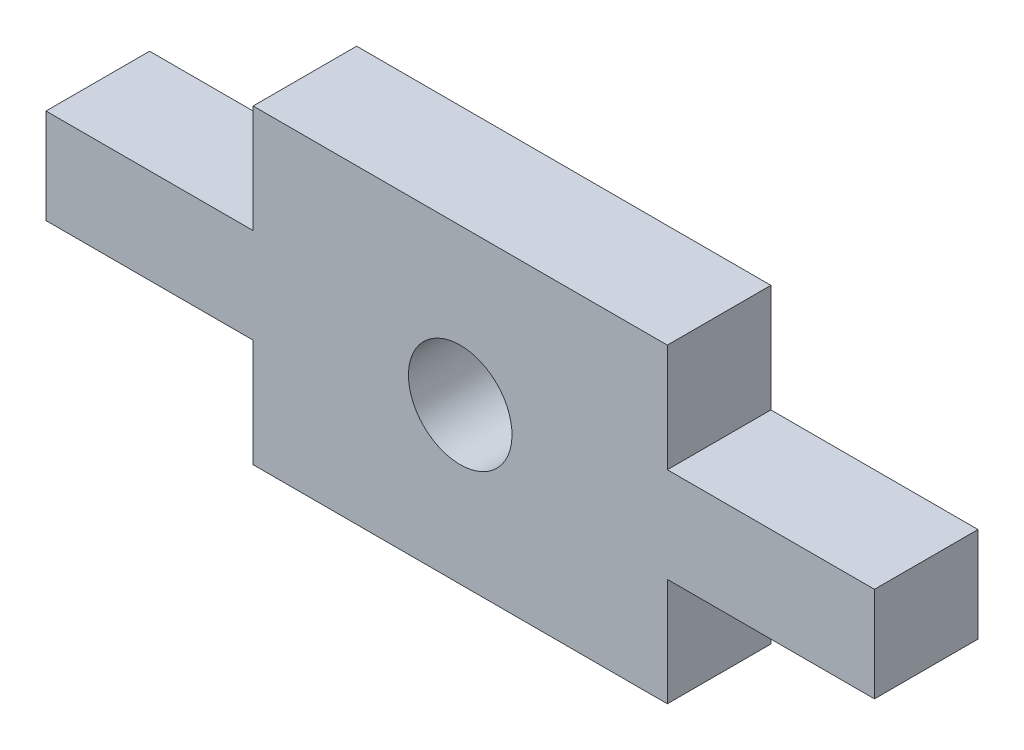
ISO-10303-21;
HEADER;
FILE_DESCRIPTION(('STEP AP214'),'2;1');
FILE_NAME('part.step','',(''),(''),'','','');
FILE_SCHEMA(('AUTOMOTIVE_DESIGN { 1 0 10303 214 1 1 1 1 }'));
ENDSEC;
DATA;
#1=APPLICATION_CONTEXT('core data for automotive mechanical design processes');
#2=APPLICATION_PROTOCOL_DEFINITION('international standard','automotive_design',2000,#1);
#3=PRODUCT_CONTEXT('',#1,'mechanical');
#4=PRODUCT('Part','Part','',(#3));
#5=PRODUCT_RELATED_PRODUCT_CATEGORY('part','',(#4));
#6=PRODUCT_DEFINITION_FORMATION('','',#4);
#7=PRODUCT_DEFINITION_CONTEXT('part definition',#1,'design');
#8=PRODUCT_DEFINITION('design','',#6,#7);
#9=PRODUCT_DEFINITION_SHAPE('','',#8);
#10=(LENGTH_UNIT() NAMED_UNIT(*) SI_UNIT(.MILLI.,.METRE.));
#11=(NAMED_UNIT(*) PLANE_ANGLE_UNIT() SI_UNIT($,.RADIAN.));
#12=(NAMED_UNIT(*) SI_UNIT($,.STERADIAN.) SOLID_ANGLE_UNIT());
#13=UNCERTAINTY_MEASURE_WITH_UNIT(LENGTH_MEASURE(1.E-05),#10,'distance_accuracy_value','');
#14=(GEOMETRIC_REPRESENTATION_CONTEXT(3) GLOBAL_UNCERTAINTY_ASSIGNED_CONTEXT((#13)) GLOBAL_UNIT_ASSIGNED_CONTEXT((#10,
#11,#12)) REPRESENTATION_CONTEXT('',''));
#15=CARTESIAN_POINT('',(0.,0.,0.));
#16=DIRECTION('',(0.,0.,1.));
#17=DIRECTION('',(1.,0.,0.));
#18=AXIS2_PLACEMENT_3D('',#15,#16,#17);
#19=CARTESIAN_POINT('',(-97.7445255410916,152.496309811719,0.));
#20=DIRECTION('',(0.,0.,-1.));
#21=DIRECTION('',(-1.,0.,0.));
#22=AXIS2_PLACEMENT_3D('',#19,#20,#21);
#23=PLANE('',#22);
#24=DIRECTION('',(1.,0.,0.));
#25=VECTOR('',#24,1.);
#26=CARTESIAN_POINT('',(4.95746685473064,0.295,0.));
#27=LINE('',#26,#25);
#28=CARTESIAN_POINT('',(4.95746685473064,0.295,0.));
#29=VERTEX_POINT('',#28);
#30=CARTESIAN_POINT('',(10.9574668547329,0.295,0.));
#31=VERTEX_POINT('',#30);
#32=EDGE_CURVE('E152',#29,#31,#27,.T.);
#33=ORIENTED_EDGE('',*,*,#32,.F.);
#34=DIRECTION('',(1.54666151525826E-13,-1.,0.));
#35=VECTOR('',#34,1.);
#36=CARTESIAN_POINT('',(4.9574668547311,0.421517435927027,0.));
#37=LINE('',#36,#35);
#38=CARTESIAN_POINT('',(4.95746685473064,3.42151743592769,0.));
#39=VERTEX_POINT('',#38);
#40=EDGE_CURVE('E148',#29,#39,#37,.F.);
#41=ORIENTED_EDGE('',*,*,#40,.T.);
#42=DIRECTION('',(1.,0.,0.));
#43=VECTOR('',#42,1.);
#44=CARTESIAN_POINT('',(-7.04253314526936,3.4215174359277,0.));
#45=LINE('',#44,#43);
#46=CARTESIAN_POINT('',(-7.04253314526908,3.4215174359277,0.));
#47=VERTEX_POINT('',#46);
#48=EDGE_CURVE('E218',#39,#47,#45,.F.);
#49=ORIENTED_EDGE('',*,*,#48,.T.);
#50=DIRECTION('',(-1.53283740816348E-13,1.,0.));
#51=VECTOR('',#50,1.);
#52=CARTESIAN_POINT('',(-7.04253314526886,0.421517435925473,0.));
#53=LINE('',#52,#51);
#54=CARTESIAN_POINT('',(-7.04253314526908,0.295,0.));
#55=VERTEX_POINT('',#54);
#56=EDGE_CURVE('E220',#47,#55,#53,.F.);
#57=ORIENTED_EDGE('',*,*,#56,.T.);
#58=DIRECTION('',(1.,0.,0.));
#59=VECTOR('',#58,1.);
#60=CARTESIAN_POINT('',(-7.04253314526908,0.295,0.));
#61=LINE('',#60,#59);
#62=CARTESIAN_POINT('',(-13.0425331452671,0.295,0.));
#63=VERTEX_POINT('',#62);
#64=EDGE_CURVE('E176',#63,#55,#61,.T.);
#65=ORIENTED_EDGE('',*,*,#64,.F.);
#66=DIRECTION('',(-1.60645092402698E-13,1.,0.));
#67=VECTOR('',#66,1.);
#68=CARTESIAN_POINT('',(-13.0425331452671,0.421517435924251,0.));
#69=LINE('',#68,#67);
#70=CARTESIAN_POINT('',(-13.0425331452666,-2.455,0.));
#71=VERTEX_POINT('',#70);
#72=EDGE_CURVE('E222',#63,#71,#69,.F.);
#73=ORIENTED_EDGE('',*,*,#72,.T.);
#74=DIRECTION('',(-1.,0.,0.));
#75=VECTOR('',#74,1.);
#76=CARTESIAN_POINT('',(-7.04253314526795,-2.455,0.));
#77=LINE('',#76,#75);
#78=CARTESIAN_POINT('',(-7.04253314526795,-2.455,0.));
#79=VERTEX_POINT('',#78);
#80=EDGE_CURVE('E165',#79,#71,#77,.T.);
#81=ORIENTED_EDGE('',*,*,#80,.F.);
#82=DIRECTION('',(-1.55967935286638E-13,1.,0.));
#83=VECTOR('',#82,1.);
#84=CARTESIAN_POINT('',(-7.04253314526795,-5.57848256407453,0.));
#85=LINE('',#84,#83);
#86=CARTESIAN_POINT('',(-7.04253314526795,-5.57848256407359,0.));
#87=VERTEX_POINT('',#86);
#88=EDGE_CURVE('E202',#79,#87,#85,.F.);
#89=ORIENTED_EDGE('',*,*,#88,.T.);
#90=DIRECTION('',(-1.,-1.56274561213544E-13,0.));
#91=VECTOR('',#90,1.);
#92=CARTESIAN_POINT('',(-7.04253314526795,-5.57848256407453,0.));
#93=LINE('',#92,#91);
#94=CARTESIAN_POINT('',(4.95746685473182,-5.57848256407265,0.));
#95=VERTEX_POINT('',#94);
#96=EDGE_CURVE('E206',#87,#95,#93,.F.);
#97=ORIENTED_EDGE('',*,*,#96,.T.);
#98=DIRECTION('',(1.54281545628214E-13,-1.,0.));
#99=VECTOR('',#98,1.);
#100=CARTESIAN_POINT('',(4.95746685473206,-5.57848256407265,0.));
#101=LINE('',#100,#99);
#102=CARTESIAN_POINT('',(4.95746685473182,-2.455,0.));
#103=VERTEX_POINT('',#102);
#104=EDGE_CURVE('E208',#95,#103,#101,.F.);
#105=ORIENTED_EDGE('',*,*,#104,.T.);
#106=DIRECTION('',(-1.,0.,0.));
#107=VECTOR('',#106,1.);
#108=CARTESIAN_POINT('',(4.95746685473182,-2.455,0.));
#109=LINE('',#108,#107);
#110=CARTESIAN_POINT('',(10.9574668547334,-2.455,0.));
#111=VERTEX_POINT('',#110);
#112=EDGE_CURVE('E157',#111,#103,#109,.T.);
#113=ORIENTED_EDGE('',*,*,#112,.F.);
#114=DIRECTION('',(1.67008639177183E-13,-1.,0.));
#115=VECTOR('',#114,1.);
#116=CARTESIAN_POINT('',(10.9574668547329,0.421517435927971,0.));
#117=LINE('',#116,#115);
#118=EDGE_CURVE('E210',#111,#31,#117,.F.);
#119=ORIENTED_EDGE('',*,*,#118,.T.);
#120=EDGE_LOOP('',(#33,#41,#49,#57,#65,#73,#81,#89,#97,#105,#113,#119));
#121=FACE_BOUND('',#120,.T.);
#122=CARTESIAN_POINT('',(-1.04253314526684,-1.07848256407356,0.));
#123=DIRECTION('',(0.,0.,-1.));
#124=DIRECTION('',(-1.,0.,0.));
#125=AXIS2_PLACEMENT_3D('',#122,#123,#124);
#126=CIRCLE('',#125,1.49999999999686);
#127=CARTESIAN_POINT('',(0.0359494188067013,-2.12101570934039,0.));
#128=VERTEX_POINT('',#127);
#129=CARTESIAN_POINT('',(-2.12101570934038,-0.0359494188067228,0.));
#130=VERTEX_POINT('',#129);
#131=EDGE_CURVE('E185',#128,#130,#126,.T.);
#132=ORIENTED_EDGE('',*,*,#131,.T.);
#133=CARTESIAN_POINT('',(-1.04253314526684,-1.07848256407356,0.));
#134=DIRECTION('',(0.,0.,-1.));
#135=DIRECTION('',(-1.,0.,0.));
#136=AXIS2_PLACEMENT_3D('',#133,#134,#135);
#137=CIRCLE('',#136,1.49999999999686);
#138=EDGE_CURVE('E225',#130,#128,#137,.T.);
#139=ORIENTED_EDGE('',*,*,#138,.T.);
#140=EDGE_LOOP('',(#132,#139));
#141=FACE_BOUND('',#140,.T.);
#142=ADVANCED_FACE('F30',(#121,#141),#23,.F.);
#143=CARTESIAN_POINT('',(-1.04253314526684,-1.07848256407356,0.));
#144=DIRECTION('',(0.,0.,-1.));
#145=DIRECTION('',(-1.,0.,0.));
#146=AXIS2_PLACEMENT_3D('',#143,#144,#145);
#147=CYLINDRICAL_SURFACE('',#146,1.49999999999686);
#148=CARTESIAN_POINT('',(-1.04253314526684,-1.07848256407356,-3.));
#149=DIRECTION('',(0.,0.,-1.));
#150=DIRECTION('',(-1.,0.,0.));
#151=AXIS2_PLACEMENT_3D('',#148,#149,#150);
#152=CIRCLE('',#151,1.49999999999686);
#153=CARTESIAN_POINT('',(-2.12101570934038,-0.0359494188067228,-3.));
#154=VERTEX_POINT('',#153);
#155=CARTESIAN_POINT('',(0.0359494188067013,-2.12101570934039,-3.));
#156=VERTEX_POINT('',#155);
#157=EDGE_CURVE('E201',#154,#156,#152,.F.);
#158=ORIENTED_EDGE('',*,*,#157,.F.);
#159=DIRECTION('',(0.,0.,-1.));
#160=VECTOR('',#159,1.);
#161=CARTESIAN_POINT('',(-2.12101570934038,-0.0359494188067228,0.));
#162=LINE('',#161,#160);
#163=EDGE_CURVE('E228',#154,#130,#162,.F.);
#164=ORIENTED_EDGE('',*,*,#163,.T.);
#165=ORIENTED_EDGE('',*,*,#131,.F.);
#166=DIRECTION('',(0.,0.,-1.));
#167=VECTOR('',#166,1.);
#168=CARTESIAN_POINT('',(0.0359494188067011,-2.12101570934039,0.));
#169=LINE('',#168,#167);
#170=EDGE_CURVE('E226',#128,#156,#169,.T.);
#171=ORIENTED_EDGE('',*,*,#170,.T.);
#172=EDGE_LOOP('',(#158,#164,#165,#171));
#173=FACE_BOUND('',#172,.T.);
#174=ADVANCED_FACE('F310',(#173),#147,.F.);
#175=CARTESIAN_POINT('',(-1.04253314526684,-1.07848256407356,0.));
#176=DIRECTION('',(0.,0.,-1.));
#177=DIRECTION('',(-1.,0.,0.));
#178=AXIS2_PLACEMENT_3D('',#175,#176,#177);
#179=CYLINDRICAL_SURFACE('',#178,1.49999999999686);
#180=ORIENTED_EDGE('',*,*,#163,.F.);
#181=CARTESIAN_POINT('',(-1.04253314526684,-1.07848256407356,-3.));
#182=DIRECTION('',(0.,0.,-1.));
#183=DIRECTION('',(-1.,0.,0.));
#184=AXIS2_PLACEMENT_3D('',#181,#182,#183);
#185=CIRCLE('',#184,1.49999999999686);
#186=EDGE_CURVE('E198',#156,#154,#185,.F.);
#187=ORIENTED_EDGE('',*,*,#186,.F.);
#188=ORIENTED_EDGE('',*,*,#170,.F.);
#189=ORIENTED_EDGE('',*,*,#138,.F.);
#190=EDGE_LOOP('',(#180,#187,#188,#189));
#191=FACE_BOUND('',#190,.T.);
#192=ADVANCED_FACE('F308',(#191),#179,.F.);
#193=CARTESIAN_POINT('',(-13.0425331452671,0.421517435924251,0.));
#194=DIRECTION('',(1.,1.60645092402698E-13,0.));
#195=DIRECTION('',(-1.60645092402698E-13,1.,0.));
#196=AXIS2_PLACEMENT_3D('',#193,#194,#195);
#197=PLANE('',#196);
#198=DIRECTION('',(0.,1.,0.));
#199=VECTOR('',#198,1.);
#200=CARTESIAN_POINT('',(-13.0425331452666,152.496309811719,-3.));
#201=LINE('',#200,#199);
#202=CARTESIAN_POINT('',(-13.0425331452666,-2.45500000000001,-3.));
#203=VERTEX_POINT('',#202);
#204=CARTESIAN_POINT('',(-13.0425331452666,0.295,-3.));
#205=VERTEX_POINT('',#204);
#206=EDGE_CURVE('E196',#203,#205,#201,.T.);
#207=ORIENTED_EDGE('',*,*,#206,.F.);
#208=DIRECTION('',(0.,0.,1.));
#209=VECTOR('',#208,1.);
#210=CARTESIAN_POINT('',(-13.0425331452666,-2.455,0.));
#211=LINE('',#210,#209);
#212=EDGE_CURVE('E173',#203,#71,#211,.T.);
#213=ORIENTED_EDGE('',*,*,#212,.T.);
#214=ORIENTED_EDGE('',*,*,#72,.F.);
#215=DIRECTION('',(0.,0.,-1.));
#216=VECTOR('',#215,1.);
#217=CARTESIAN_POINT('',(-13.0425331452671,0.295,0.));
#218=LINE('',#217,#216);
#219=EDGE_CURVE('E182',#63,#205,#218,.T.);
#220=ORIENTED_EDGE('',*,*,#219,.T.);
#221=EDGE_LOOP('',(#207,#213,#214,#220));
#222=FACE_BOUND('',#221,.T.);
#223=ADVANCED_FACE('F246',(#222),#197,.F.);
#224=CARTESIAN_POINT('',(-7.04253314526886,0.421517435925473,0.));
#225=DIRECTION('',(1.,1.53283740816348E-13,0.));
#226=DIRECTION('',(-1.53283740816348E-13,1.,0.));
#227=AXIS2_PLACEMENT_3D('',#224,#225,#226);
#228=PLANE('',#227);
#229=ORIENTED_EDGE('',*,*,#56,.F.);
#230=DIRECTION('',(0.,0.,1.));
#231=VECTOR('',#230,1.);
#232=CARTESIAN_POINT('',(-7.04253314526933,3.4215174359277,0.));
#233=LINE('',#232,#231);
#234=CARTESIAN_POINT('',(-7.0425331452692,3.4215174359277,-3.));
#235=VERTEX_POINT('',#234);
#236=EDGE_CURVE('E216',#47,#235,#233,.F.);
#237=ORIENTED_EDGE('',*,*,#236,.T.);
#238=DIRECTION('',(0.,1.,0.));
#239=VECTOR('',#238,1.);
#240=CARTESIAN_POINT('',(-7.04253314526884,152.496309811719,-3.));
#241=LINE('',#240,#239);
#242=CARTESIAN_POINT('',(-7.04253314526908,0.29499999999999,-3.));
#243=VERTEX_POINT('',#242);
#244=EDGE_CURVE('E194',#243,#235,#241,.T.);
#245=ORIENTED_EDGE('',*,*,#244,.F.);
#246=DIRECTION('',(0.,0.,1.));
#247=VECTOR('',#246,1.);
#248=CARTESIAN_POINT('',(-7.04253314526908,0.295,-3.));
#249=LINE('',#248,#247);
#250=EDGE_CURVE('E179',#243,#55,#249,.T.);
#251=ORIENTED_EDGE('',*,*,#250,.T.);
#252=EDGE_LOOP('',(#229,#237,#245,#251));
#253=FACE_BOUND('',#252,.T.);
#254=ADVANCED_FACE('F252',(#253),#228,.F.);
#255=CARTESIAN_POINT('',(-7.04253314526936,3.4215174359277,0.));
#256=DIRECTION('',(0.,-1.,0.));
#257=DIRECTION('',(1.,0.,0.));
#258=AXIS2_PLACEMENT_3D('',#255,#256,#257);
#259=PLANE('',#258);
#260=ORIENTED_EDGE('',*,*,#48,.F.);
#261=DIRECTION('',(0.,0.,1.));
#262=VECTOR('',#261,1.);
#263=CARTESIAN_POINT('',(4.95746685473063,3.4215174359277,0.));
#264=LINE('',#263,#262);
#265=CARTESIAN_POINT('',(4.95746685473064,3.42151743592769,-3.));
#266=VERTEX_POINT('',#265);
#267=EDGE_CURVE('E213',#39,#266,#264,.F.);
#268=ORIENTED_EDGE('',*,*,#267,.T.);
#269=DIRECTION('',(-1.,0.,0.));
#270=VECTOR('',#269,1.);
#271=CARTESIAN_POINT('',(-97.7445255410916,3.4215174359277,-3.));
#272=LINE('',#271,#270);
#273=EDGE_CURVE('E140',#235,#266,#272,.F.);
#274=ORIENTED_EDGE('',*,*,#273,.F.);
#275=ORIENTED_EDGE('',*,*,#236,.F.);
#276=EDGE_LOOP('',(#260,#268,#274,#275));
#277=FACE_BOUND('',#276,.T.);
#278=ADVANCED_FACE('F256',(#277),#259,.F.);
#279=CARTESIAN_POINT('',(4.9574668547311,0.421517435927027,0.));
#280=DIRECTION('',(-1.,-1.54666151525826E-13,0.));
#281=DIRECTION('',(1.54666151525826E-13,-1.,0.));
#282=AXIS2_PLACEMENT_3D('',#279,#280,#281);
#283=PLANE('',#282);
#284=ORIENTED_EDGE('',*,*,#40,.F.);
#285=DIRECTION('',(0.,0.,1.));
#286=VECTOR('',#285,1.);
#287=CARTESIAN_POINT('',(4.95746685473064,0.295,-3.));
#288=LINE('',#287,#286);
#289=CARTESIAN_POINT('',(4.95746685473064,0.295,-3.));
#290=VERTEX_POINT('',#289);
#291=EDGE_CURVE('E146',#290,#29,#288,.T.);
#292=ORIENTED_EDGE('',*,*,#291,.F.);
#293=DIRECTION('',(0.,1.,0.));
#294=VECTOR('',#293,1.);
#295=CARTESIAN_POINT('',(4.95746685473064,152.496309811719,-3.));
#296=LINE('',#295,#294);
#297=EDGE_CURVE('E132',#266,#290,#296,.F.);
#298=ORIENTED_EDGE('',*,*,#297,.F.);
#299=ORIENTED_EDGE('',*,*,#267,.F.);
#300=EDGE_LOOP('',(#284,#292,#298,#299));
#301=FACE_BOUND('',#300,.T.);
#302=ADVANCED_FACE('F147',(#301),#283,.F.);
#303=CARTESIAN_POINT('',(10.9574668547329,0.421517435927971,0.));
#304=DIRECTION('',(-1.,-1.67008639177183E-13,0.));
#305=DIRECTION('',(1.67008639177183E-13,-1.,0.));
#306=AXIS2_PLACEMENT_3D('',#303,#304,#305);
#307=PLANE('',#306);
#308=DIRECTION('',(0.,1.,0.));
#309=VECTOR('',#308,1.);
#310=CARTESIAN_POINT('',(10.9574668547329,152.496309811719,-3.));
#311=LINE('',#310,#309);
#312=CARTESIAN_POINT('',(10.9574668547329,0.29499999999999,-3.));
#313=VERTEX_POINT('',#312);
#314=CARTESIAN_POINT('',(10.9574668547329,-2.455,-3.));
#315=VERTEX_POINT('',#314);
#316=EDGE_CURVE('E143',#313,#315,#311,.F.);
#317=ORIENTED_EDGE('',*,*,#316,.F.);
#318=DIRECTION('',(0.,0.,1.));
#319=VECTOR('',#318,1.);
#320=CARTESIAN_POINT('',(10.9574668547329,0.295,0.));
#321=LINE('',#320,#319);
#322=EDGE_CURVE('E44',#313,#31,#321,.T.);
#323=ORIENTED_EDGE('',*,*,#322,.T.);
#324=ORIENTED_EDGE('',*,*,#118,.F.);
#325=DIRECTION('',(0.,0.,-1.));
#326=VECTOR('',#325,1.);
#327=CARTESIAN_POINT('',(10.9574668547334,-2.455,0.));
#328=LINE('',#327,#326);
#329=EDGE_CURVE('E162',#111,#315,#328,.T.);
#330=ORIENTED_EDGE('',*,*,#329,.T.);
#331=EDGE_LOOP('',(#317,#323,#324,#330));
#332=FACE_BOUND('',#331,.T.);
#333=ADVANCED_FACE('F260',(#332),#307,.F.);
#334=CARTESIAN_POINT('',(4.95746685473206,-5.57848256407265,0.));
#335=DIRECTION('',(-1.,-1.54281545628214E-13,0.));
#336=DIRECTION('',(1.54281545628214E-13,-1.,0.));
#337=AXIS2_PLACEMENT_3D('',#334,#335,#336);
#338=PLANE('',#337);
#339=ORIENTED_EDGE('',*,*,#104,.F.);
#340=DIRECTION('',(0.,0.,1.));
#341=VECTOR('',#340,1.);
#342=CARTESIAN_POINT('',(4.95746685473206,-5.57848256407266,0.));
#343=LINE('',#342,#341);
#344=CARTESIAN_POINT('',(4.95746685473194,-5.57848256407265,-3.));
#345=VERTEX_POINT('',#344);
#346=EDGE_CURVE('E204',#95,#345,#343,.F.);
#347=ORIENTED_EDGE('',*,*,#346,.T.);
#348=DIRECTION('',(0.,1.,0.));
#349=VECTOR('',#348,1.);
#350=CARTESIAN_POINT('',(4.95746685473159,152.496309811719,-3.));
#351=LINE('',#350,#349);
#352=CARTESIAN_POINT('',(4.95746685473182,-2.45500000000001,-3.));
#353=VERTEX_POINT('',#352);
#354=EDGE_CURVE('E52',#353,#345,#351,.F.);
#355=ORIENTED_EDGE('',*,*,#354,.F.);
#356=DIRECTION('',(0.,0.,1.));
#357=VECTOR('',#356,1.);
#358=CARTESIAN_POINT('',(4.95746685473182,-2.455,-3.));
#359=LINE('',#358,#357);
#360=EDGE_CURVE('E160',#353,#103,#359,.T.);
#361=ORIENTED_EDGE('',*,*,#360,.T.);
#362=EDGE_LOOP('',(#339,#347,#355,#361));
#363=FACE_BOUND('',#362,.T.);
#364=ADVANCED_FACE('F265',(#363),#338,.F.);
#365=CARTESIAN_POINT('',(-7.04253314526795,-5.57848256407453,0.));
#366=DIRECTION('',(-1.56274561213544E-13,1.,0.));
#367=DIRECTION('',(-1.,-1.56274561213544E-13,0.));
#368=AXIS2_PLACEMENT_3D('',#365,#366,#367);
#369=PLANE('',#368);
#370=ORIENTED_EDGE('',*,*,#96,.F.);
#371=DIRECTION('',(0.,0.,1.));
#372=VECTOR('',#371,1.);
#373=CARTESIAN_POINT('',(-7.04253314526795,-5.57848256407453,0.));
#374=LINE('',#373,#372);
#375=CARTESIAN_POINT('',(-7.04253314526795,-5.57848256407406,-3.));
#376=VERTEX_POINT('',#375);
#377=EDGE_CURVE('E199',#87,#376,#374,.F.);
#378=ORIENTED_EDGE('',*,*,#377,.T.);
#379=DIRECTION('',(-1.,0.,0.));
#380=VECTOR('',#379,1.);
#381=CARTESIAN_POINT('',(-97.7445255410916,-5.57848256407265,-3.));
#382=LINE('',#381,#380);
#383=EDGE_CURVE('E188',#345,#376,#382,.T.);
#384=ORIENTED_EDGE('',*,*,#383,.F.);
#385=ORIENTED_EDGE('',*,*,#346,.F.);
#386=EDGE_LOOP('',(#370,#378,#384,#385));
#387=FACE_BOUND('',#386,.T.);
#388=ADVANCED_FACE('F270',(#387),#369,.F.);
#389=CARTESIAN_POINT('',(-7.04253314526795,-5.57848256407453,0.));
#390=DIRECTION('',(1.,1.55967935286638E-13,0.));
#391=DIRECTION('',(-1.55967935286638E-13,1.,0.));
#392=AXIS2_PLACEMENT_3D('',#389,#390,#391);
#393=PLANE('',#392);
#394=ORIENTED_EDGE('',*,*,#88,.F.);
#395=DIRECTION('',(0.,0.,1.));
#396=VECTOR('',#395,1.);
#397=CARTESIAN_POINT('',(-7.04253314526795,-2.455,-3.));
#398=LINE('',#397,#396);
#399=CARTESIAN_POINT('',(-7.04253314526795,-2.455,-3.));
#400=VERTEX_POINT('',#399);
#401=EDGE_CURVE('E169',#400,#79,#398,.T.);
#402=ORIENTED_EDGE('',*,*,#401,.F.);
#403=DIRECTION('',(0.,1.,0.));
#404=VECTOR('',#403,1.);
#405=CARTESIAN_POINT('',(-7.04253314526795,152.496309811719,-3.));
#406=LINE('',#405,#404);
#407=EDGE_CURVE('E186',#376,#400,#406,.T.);
#408=ORIENTED_EDGE('',*,*,#407,.F.);
#409=ORIENTED_EDGE('',*,*,#377,.F.);
#410=EDGE_LOOP('',(#394,#402,#408,#409));
#411=FACE_BOUND('',#410,.T.);
#412=ADVANCED_FACE('F276',(#411),#393,.F.);
#413=CARTESIAN_POINT('',(-97.7445255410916,152.496309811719,-3.));
#414=DIRECTION('',(0.,0.,-1.));
#415=DIRECTION('',(-1.,0.,0.));
#416=AXIS2_PLACEMENT_3D('',#413,#414,#415);
#417=PLANE('',#416);
#418=ORIENTED_EDGE('',*,*,#297,.T.);
#419=DIRECTION('',(1.,0.,0.));
#420=VECTOR('',#419,1.);
#421=CARTESIAN_POINT('',(4.95746685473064,0.295,-3.));
#422=LINE('',#421,#420);
#423=EDGE_CURVE('E136',#290,#313,#422,.T.);
#424=ORIENTED_EDGE('',*,*,#423,.T.);
#425=ORIENTED_EDGE('',*,*,#316,.T.);
#426=DIRECTION('',(1.,0.,0.));
#427=VECTOR('',#426,1.);
#428=CARTESIAN_POINT('',(-97.7445255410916,-2.45500000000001,-3.));
#429=LINE('',#428,#427);
#430=EDGE_CURVE('E11',#353,#315,#429,.T.);
#431=ORIENTED_EDGE('',*,*,#430,.F.);
#432=ORIENTED_EDGE('',*,*,#354,.T.);
#433=ORIENTED_EDGE('',*,*,#383,.T.);
#434=ORIENTED_EDGE('',*,*,#407,.T.);
#435=DIRECTION('',(-1.,0.,0.));
#436=VECTOR('',#435,1.);
#437=CARTESIAN_POINT('',(-7.04253314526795,-2.455,-3.));
#438=LINE('',#437,#436);
#439=EDGE_CURVE('E166',#400,#203,#438,.T.);
#440=ORIENTED_EDGE('',*,*,#439,.T.);
#441=ORIENTED_EDGE('',*,*,#206,.T.);
#442=DIRECTION('',(-1.,0.,0.));
#443=VECTOR('',#442,1.);
#444=CARTESIAN_POINT('',(-97.7445255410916,0.29499999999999,-3.));
#445=LINE('',#444,#443);
#446=EDGE_CURVE('E37',#243,#205,#445,.T.);
#447=ORIENTED_EDGE('',*,*,#446,.F.);
#448=ORIENTED_EDGE('',*,*,#244,.T.);
#449=ORIENTED_EDGE('',*,*,#273,.T.);
#450=EDGE_LOOP('',(#418,#424,#425,#431,#432,#433,#434,#440,#441,#447,#448,#449));
#451=FACE_BOUND('',#450,.T.);
#452=ORIENTED_EDGE('',*,*,#157,.T.);
#453=ORIENTED_EDGE('',*,*,#186,.T.);
#454=EDGE_LOOP('',(#452,#453));
#455=FACE_BOUND('',#454,.T.);
#456=ADVANCED_FACE('F134',(#451,#455),#417,.T.);
#457=CARTESIAN_POINT('',(-7.04253314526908,0.295,-3.));
#458=DIRECTION('',(0.,-1.,0.));
#459=DIRECTION('',(0.,0.,-1.));
#460=AXIS2_PLACEMENT_3D('',#457,#458,#459);
#461=PLANE('',#460);
#462=ORIENTED_EDGE('',*,*,#64,.T.);
#463=ORIENTED_EDGE('',*,*,#250,.F.);
#464=ORIENTED_EDGE('',*,*,#446,.T.);
#465=ORIENTED_EDGE('',*,*,#219,.F.);
#466=EDGE_LOOP('',(#462,#463,#464,#465));
#467=FACE_BOUND('',#466,.T.);
#468=ADVANCED_FACE('F241',(#467),#461,.F.);
#469=CARTESIAN_POINT('',(-7.04253314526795,-2.455,-3.));
#470=DIRECTION('',(0.,1.,0.));
#471=DIRECTION('',(0.,0.,1.));
#472=AXIS2_PLACEMENT_3D('',#469,#470,#471);
#473=PLANE('',#472);
#474=ORIENTED_EDGE('',*,*,#439,.F.);
#475=ORIENTED_EDGE('',*,*,#401,.T.);
#476=ORIENTED_EDGE('',*,*,#80,.T.);
#477=ORIENTED_EDGE('',*,*,#212,.F.);
#478=EDGE_LOOP('',(#474,#475,#476,#477));
#479=FACE_BOUND('',#478,.T.);
#480=ADVANCED_FACE('F278',(#479),#473,.F.);
#481=CARTESIAN_POINT('',(4.95746685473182,-2.455,-3.));
#482=DIRECTION('',(0.,1.,0.));
#483=DIRECTION('',(0.,0.,1.));
#484=AXIS2_PLACEMENT_3D('',#481,#482,#483);
#485=PLANE('',#484);
#486=ORIENTED_EDGE('',*,*,#112,.T.);
#487=ORIENTED_EDGE('',*,*,#360,.F.);
#488=ORIENTED_EDGE('',*,*,#430,.T.);
#489=ORIENTED_EDGE('',*,*,#329,.F.);
#490=EDGE_LOOP('',(#486,#487,#488,#489));
#491=FACE_BOUND('',#490,.T.);
#492=ADVANCED_FACE('F263',(#491),#485,.F.);
#493=CARTESIAN_POINT('',(4.95746685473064,0.295,-3.));
#494=DIRECTION('',(0.,-1.,0.));
#495=DIRECTION('',(0.,0.,-1.));
#496=AXIS2_PLACEMENT_3D('',#493,#494,#495);
#497=PLANE('',#496);
#498=ORIENTED_EDGE('',*,*,#423,.F.);
#499=ORIENTED_EDGE('',*,*,#291,.T.);
#500=ORIENTED_EDGE('',*,*,#32,.T.);
#501=ORIENTED_EDGE('',*,*,#322,.F.);
#502=EDGE_LOOP('',(#498,#499,#500,#501));
#503=FACE_BOUND('',#502,.T.);
#504=ADVANCED_FACE('F151',(#503),#497,.F.);
#505=CLOSED_SHELL('',(#142,#174,#192,#223,#254,#278,#302,#333,#364,#388,#412,#456,#468,#480,
#492,#504));
#506=MANIFOLD_SOLID_BREP('B2',#505);
#507=ADVANCED_BREP_SHAPE_REPRESENTATION('',(#18,#506),#14);
#508=SHAPE_DEFINITION_REPRESENTATION(#9,#507);
ENDSEC;
END-ISO-10303-21;
